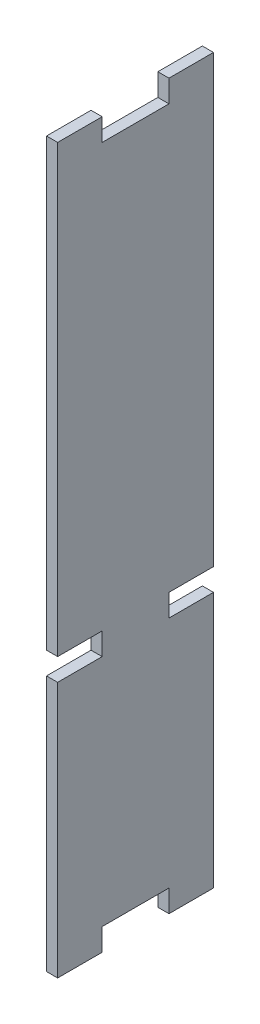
ISO-10303-21;
HEADER;
FILE_DESCRIPTION(('STEP AP214'),'2;1');
FILE_NAME('part.step','',(''),(''),'','','');
FILE_SCHEMA(('AUTOMOTIVE_DESIGN { 1 0 10303 214 1 1 1 1 }'));
ENDSEC;
DATA;
#1=APPLICATION_CONTEXT('core data for automotive mechanical design processes');
#2=APPLICATION_PROTOCOL_DEFINITION('international standard','automotive_design',2000,#1);
#3=PRODUCT_CONTEXT('',#1,'mechanical');
#4=PRODUCT('Part','Part','',(#3));
#5=PRODUCT_RELATED_PRODUCT_CATEGORY('part','',(#4));
#6=PRODUCT_DEFINITION_FORMATION('','',#4);
#7=PRODUCT_DEFINITION_CONTEXT('part definition',#1,'design');
#8=PRODUCT_DEFINITION('design','',#6,#7);
#9=PRODUCT_DEFINITION_SHAPE('','',#8);
#10=(LENGTH_UNIT() NAMED_UNIT(*) SI_UNIT(.MILLI.,.METRE.));
#11=(NAMED_UNIT(*) PLANE_ANGLE_UNIT() SI_UNIT($,.RADIAN.));
#12=(NAMED_UNIT(*) SI_UNIT($,.STERADIAN.) SOLID_ANGLE_UNIT());
#13=UNCERTAINTY_MEASURE_WITH_UNIT(LENGTH_MEASURE(1.E-05),#10,'distance_accuracy_value','');
#14=(GEOMETRIC_REPRESENTATION_CONTEXT(3) GLOBAL_UNCERTAINTY_ASSIGNED_CONTEXT((#13)) GLOBAL_UNIT_ASSIGNED_CONTEXT((#10,
#11,#12)) REPRESENTATION_CONTEXT('',''));
#15=CARTESIAN_POINT('',(0.,0.,0.));
#16=DIRECTION('',(0.,0.,1.));
#17=DIRECTION('',(1.,0.,0.));
#18=AXIS2_PLACEMENT_3D('',#15,#16,#17);
#19=CARTESIAN_POINT('',(3.175,0.,9.525));
#20=DIRECTION('',(0.,0.,1.));
#21=DIRECTION('',(0.,-1.,0.));
#22=AXIS2_PLACEMENT_3D('',#19,#20,#21);
#23=PLANE('',#22);
#24=DIRECTION('',(0.,1.,0.));
#25=VECTOR('',#24,1.);
#26=CARTESIAN_POINT('',(0.,0.,9.525));
#27=LINE('',#26,#25);
#28=CARTESIAN_POINT('',(0.,-6.35,9.525));
#29=VERTEX_POINT('',#28);
#30=CARTESIAN_POINT('',(0.,0.,9.525));
#31=VERTEX_POINT('',#30);
#32=EDGE_CURVE('E199',#29,#31,#27,.T.);
#33=ORIENTED_EDGE('',*,*,#32,.T.);
#34=DIRECTION('',(-1.,0.,0.));
#35=VECTOR('',#34,1.);
#36=CARTESIAN_POINT('',(3.175,0.,9.525));
#37=LINE('',#36,#35);
#38=CARTESIAN_POINT('',(3.175,0.,9.525));
#39=VERTEX_POINT('',#38);
#40=EDGE_CURVE('E11',#39,#31,#37,.T.);
#41=ORIENTED_EDGE('',*,*,#40,.F.);
#42=DIRECTION('',(0.,1.,0.));
#43=VECTOR('',#42,1.);
#44=CARTESIAN_POINT('',(3.175,0.,9.525));
#45=LINE('',#44,#43);
#46=CARTESIAN_POINT('',(3.175,-6.35,9.525));
#47=VERTEX_POINT('',#46);
#48=EDGE_CURVE('E237',#47,#39,#45,.T.);
#49=ORIENTED_EDGE('',*,*,#48,.F.);
#50=DIRECTION('',(-1.,0.,0.));
#51=VECTOR('',#50,1.);
#52=CARTESIAN_POINT('',(3.175,-6.35,9.525));
#53=LINE('',#52,#51);
#54=EDGE_CURVE('E195',#47,#29,#53,.T.);
#55=ORIENTED_EDGE('',*,*,#54,.T.);
#56=EDGE_LOOP('',(#33,#41,#49,#55));
#57=FACE_BOUND('',#56,.T.);
#58=ADVANCED_FACE('F31',(#57),#23,.F.);
#59=CARTESIAN_POINT('',(3.175,0.,9.525));
#60=DIRECTION('',(0.,1.,0.));
#61=DIRECTION('',(0.,0.,1.));
#62=AXIS2_PLACEMENT_3D('',#59,#60,#61);
#63=PLANE('',#62);
#64=DIRECTION('',(0.,0.,-1.));
#65=VECTOR('',#64,1.);
#66=CARTESIAN_POINT('',(0.,0.,9.525));
#67=LINE('',#66,#65);
#68=CARTESIAN_POINT('',(0.,0.,-9.525));
#69=VERTEX_POINT('',#68);
#70=EDGE_CURVE('E202',#31,#69,#67,.T.);
#71=ORIENTED_EDGE('',*,*,#70,.T.);
#72=DIRECTION('',(-1.,0.,0.));
#73=VECTOR('',#72,1.);
#74=CARTESIAN_POINT('',(3.175,0.,-9.525));
#75=LINE('',#74,#73);
#76=CARTESIAN_POINT('',(3.175,0.,-9.525));
#77=VERTEX_POINT('',#76);
#78=EDGE_CURVE('E39',#77,#69,#75,.T.);
#79=ORIENTED_EDGE('',*,*,#78,.F.);
#80=DIRECTION('',(0.,0.,-1.));
#81=VECTOR('',#80,1.);
#82=CARTESIAN_POINT('',(3.175,0.,9.525));
#83=LINE('',#82,#81);
#84=EDGE_CURVE('E126',#39,#77,#83,.T.);
#85=ORIENTED_EDGE('',*,*,#84,.F.);
#86=ORIENTED_EDGE('',*,*,#40,.T.);
#87=EDGE_LOOP('',(#71,#79,#85,#86));
#88=FACE_BOUND('',#87,.T.);
#89=ADVANCED_FACE('F355',(#88),#63,.F.);
#90=CARTESIAN_POINT('',(3.175,0.,-9.525));
#91=DIRECTION('',(0.,0.,-1.));
#92=DIRECTION('',(0.,1.,0.));
#93=AXIS2_PLACEMENT_3D('',#90,#91,#92);
#94=PLANE('',#93);
#95=DIRECTION('',(0.,-1.,0.));
#96=VECTOR('',#95,1.);
#97=CARTESIAN_POINT('',(0.,0.,-9.525));
#98=LINE('',#97,#96);
#99=CARTESIAN_POINT('',(0.,-6.35,-9.525));
#100=VERTEX_POINT('',#99);
#101=EDGE_CURVE('E204',#69,#100,#98,.T.);
#102=ORIENTED_EDGE('',*,*,#101,.T.);
#103=DIRECTION('',(-1.,0.,0.));
#104=VECTOR('',#103,1.);
#105=CARTESIAN_POINT('',(3.175,-6.35,-9.525));
#106=LINE('',#105,#104);
#107=CARTESIAN_POINT('',(3.175,-6.35,-9.525));
#108=VERTEX_POINT('',#107);
#109=EDGE_CURVE('E280',#108,#100,#106,.T.);
#110=ORIENTED_EDGE('',*,*,#109,.F.);
#111=DIRECTION('',(0.,-1.,0.));
#112=VECTOR('',#111,1.);
#113=CARTESIAN_POINT('',(3.175,0.,-9.525));
#114=LINE('',#113,#112);
#115=EDGE_CURVE('E288',#77,#108,#114,.T.);
#116=ORIENTED_EDGE('',*,*,#115,.F.);
#117=ORIENTED_EDGE('',*,*,#78,.T.);
#118=EDGE_LOOP('',(#102,#110,#116,#117));
#119=FACE_BOUND('',#118,.T.);
#120=ADVANCED_FACE('F286',(#119),#94,.F.);
#121=CARTESIAN_POINT('',(3.175,-6.35,-9.525));
#122=DIRECTION('',(0.,1.,0.));
#123=DIRECTION('',(0.,0.,1.));
#124=AXIS2_PLACEMENT_3D('',#121,#122,#123);
#125=PLANE('',#124);
#126=DIRECTION('',(0.,0.,-1.));
#127=VECTOR('',#126,1.);
#128=CARTESIAN_POINT('',(0.,-6.35,-9.525));
#129=LINE('',#128,#127);
#130=CARTESIAN_POINT('',(0.,-6.35,-22.225));
#131=VERTEX_POINT('',#130);
#132=EDGE_CURVE('E206',#100,#131,#129,.T.);
#133=ORIENTED_EDGE('',*,*,#132,.T.);
#134=DIRECTION('',(-1.,0.,0.));
#135=VECTOR('',#134,1.);
#136=CARTESIAN_POINT('',(3.175,-6.35,-22.225));
#137=LINE('',#136,#135);
#138=CARTESIAN_POINT('',(3.175,-6.35,-22.225));
#139=VERTEX_POINT('',#138);
#140=EDGE_CURVE('E277',#139,#131,#137,.T.);
#141=ORIENTED_EDGE('',*,*,#140,.F.);
#142=DIRECTION('',(0.,0.,-1.));
#143=VECTOR('',#142,1.);
#144=CARTESIAN_POINT('',(3.175,-6.35,-9.525));
#145=LINE('',#144,#143);
#146=EDGE_CURVE('E306',#108,#139,#145,.T.);
#147=ORIENTED_EDGE('',*,*,#146,.F.);
#148=ORIENTED_EDGE('',*,*,#109,.T.);
#149=EDGE_LOOP('',(#133,#141,#147,#148));
#150=FACE_BOUND('',#149,.T.);
#151=ADVANCED_FACE('F297',(#150),#125,.F.);
#152=CARTESIAN_POINT('',(3.175,-6.35,-22.225));
#153=DIRECTION('',(0.,0.,1.));
#154=DIRECTION('',(1.,0.,0.));
#155=AXIS2_PLACEMENT_3D('',#152,#153,#154);
#156=PLANE('',#155);
#157=DIRECTION('',(0.,1.,0.));
#158=VECTOR('',#157,1.);
#159=CARTESIAN_POINT('',(0.,-6.35,-22.225));
#160=LINE('',#159,#158);
#161=CARTESIAN_POINT('',(0.,66.675,-22.225));
#162=VERTEX_POINT('',#161);
#163=EDGE_CURVE('E208',#131,#162,#160,.T.);
#164=ORIENTED_EDGE('',*,*,#163,.T.);
#165=DIRECTION('',(-1.,0.,0.));
#166=VECTOR('',#165,1.);
#167=CARTESIAN_POINT('',(3.175,66.675,-22.225));
#168=LINE('',#167,#166);
#169=CARTESIAN_POINT('',(3.175,66.675,-22.225));
#170=VERTEX_POINT('',#169);
#171=EDGE_CURVE('E274',#170,#162,#168,.T.);
#172=ORIENTED_EDGE('',*,*,#171,.F.);
#173=DIRECTION('',(0.,1.,0.));
#174=VECTOR('',#173,1.);
#175=CARTESIAN_POINT('',(3.175,-6.35,-22.225));
#176=LINE('',#175,#174);
#177=EDGE_CURVE('E303',#139,#170,#176,.T.);
#178=ORIENTED_EDGE('',*,*,#177,.F.);
#179=ORIENTED_EDGE('',*,*,#140,.T.);
#180=EDGE_LOOP('',(#164,#172,#178,#179));
#181=FACE_BOUND('',#180,.T.);
#182=ADVANCED_FACE('F301',(#181),#156,.F.);
#183=CARTESIAN_POINT('',(3.175,66.675,-22.225));
#184=DIRECTION('',(0.,-1.,0.));
#185=DIRECTION('',(0.,0.,-1.));
#186=AXIS2_PLACEMENT_3D('',#183,#184,#185);
#187=PLANE('',#186);
#188=DIRECTION('',(0.,0.,1.));
#189=VECTOR('',#188,1.);
#190=CARTESIAN_POINT('',(0.,66.675,-22.225));
#191=LINE('',#190,#189);
#192=CARTESIAN_POINT('',(0.,66.675,-9.52500000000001));
#193=VERTEX_POINT('',#192);
#194=EDGE_CURVE('E210',#162,#193,#191,.T.);
#195=ORIENTED_EDGE('',*,*,#194,.T.);
#196=DIRECTION('',(-1.,0.,0.));
#197=VECTOR('',#196,1.);
#198=CARTESIAN_POINT('',(3.175,66.675,-9.52500000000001));
#199=LINE('',#198,#197);
#200=CARTESIAN_POINT('',(3.175,66.675,-9.52500000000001));
#201=VERTEX_POINT('',#200);
#202=EDGE_CURVE('E271',#201,#193,#199,.T.);
#203=ORIENTED_EDGE('',*,*,#202,.F.);
#204=DIRECTION('',(0.,0.,1.));
#205=VECTOR('',#204,1.);
#206=CARTESIAN_POINT('',(3.175,66.675,-22.225));
#207=LINE('',#206,#205);
#208=EDGE_CURVE('E305',#170,#201,#207,.T.);
#209=ORIENTED_EDGE('',*,*,#208,.F.);
#210=ORIENTED_EDGE('',*,*,#171,.T.);
#211=EDGE_LOOP('',(#195,#203,#209,#210));
#212=FACE_BOUND('',#211,.T.);
#213=ADVANCED_FACE('F368',(#212),#187,.F.);
#214=CARTESIAN_POINT('',(3.175,66.675,-9.52500000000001));
#215=DIRECTION('',(0.,0.,1.));
#216=DIRECTION('',(0.,-1.,0.));
#217=AXIS2_PLACEMENT_3D('',#214,#215,#216);
#218=PLANE('',#217);
#219=DIRECTION('',(0.,1.,0.));
#220=VECTOR('',#219,1.);
#221=CARTESIAN_POINT('',(0.,66.675,-9.52500000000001));
#222=LINE('',#221,#220);
#223=CARTESIAN_POINT('',(0.,73.025,-9.52500000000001));
#224=VERTEX_POINT('',#223);
#225=EDGE_CURVE('E212',#193,#224,#222,.T.);
#226=ORIENTED_EDGE('',*,*,#225,.T.);
#227=DIRECTION('',(-1.,0.,0.));
#228=VECTOR('',#227,1.);
#229=CARTESIAN_POINT('',(3.175,73.025,-9.52500000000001));
#230=LINE('',#229,#228);
#231=CARTESIAN_POINT('',(3.175,73.025,-9.52500000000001));
#232=VERTEX_POINT('',#231);
#233=EDGE_CURVE('E268',#232,#224,#230,.T.);
#234=ORIENTED_EDGE('',*,*,#233,.F.);
#235=DIRECTION('',(0.,1.,0.));
#236=VECTOR('',#235,1.);
#237=CARTESIAN_POINT('',(3.175,66.675,-9.52500000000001));
#238=LINE('',#237,#236);
#239=EDGE_CURVE('E308',#201,#232,#238,.T.);
#240=ORIENTED_EDGE('',*,*,#239,.F.);
#241=ORIENTED_EDGE('',*,*,#202,.T.);
#242=EDGE_LOOP('',(#226,#234,#240,#241));
#243=FACE_BOUND('',#242,.T.);
#244=ADVANCED_FACE('F371',(#243),#218,.F.);
#245=CARTESIAN_POINT('',(3.175,73.025,-9.52500000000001));
#246=DIRECTION('',(0.,1.,0.));
#247=DIRECTION('',(0.,0.,1.));
#248=AXIS2_PLACEMENT_3D('',#245,#246,#247);
#249=PLANE('',#248);
#250=DIRECTION('',(0.,0.,-1.));
#251=VECTOR('',#250,1.);
#252=CARTESIAN_POINT('',(0.,73.025,-9.52500000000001));
#253=LINE('',#252,#251);
#254=CARTESIAN_POINT('',(0.,73.025,-22.225));
#255=VERTEX_POINT('',#254);
#256=EDGE_CURVE('E214',#224,#255,#253,.T.);
#257=ORIENTED_EDGE('',*,*,#256,.T.);
#258=DIRECTION('',(-1.,0.,0.));
#259=VECTOR('',#258,1.);
#260=CARTESIAN_POINT('',(3.175,73.025,-22.225));
#261=LINE('',#260,#259);
#262=CARTESIAN_POINT('',(3.175,73.025,-22.225));
#263=VERTEX_POINT('',#262);
#264=EDGE_CURVE('E265',#263,#255,#261,.T.);
#265=ORIENTED_EDGE('',*,*,#264,.F.);
#266=DIRECTION('',(0.,0.,-1.));
#267=VECTOR('',#266,1.);
#268=CARTESIAN_POINT('',(3.175,73.025,-9.52500000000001));
#269=LINE('',#268,#267);
#270=EDGE_CURVE('E314',#232,#263,#269,.T.);
#271=ORIENTED_EDGE('',*,*,#270,.F.);
#272=ORIENTED_EDGE('',*,*,#233,.T.);
#273=EDGE_LOOP('',(#257,#265,#271,#272));
#274=FACE_BOUND('',#273,.T.);
#275=ADVANCED_FACE('F375',(#274),#249,.F.);
#276=CARTESIAN_POINT('',(3.175,73.025,-22.225));
#277=DIRECTION('',(0.,0.,1.));
#278=DIRECTION('',(1.,0.,0.));
#279=AXIS2_PLACEMENT_3D('',#276,#277,#278);
#280=PLANE('',#279);
#281=DIRECTION('',(0.,1.,0.));
#282=VECTOR('',#281,1.);
#283=CARTESIAN_POINT('',(0.,73.025,-22.225));
#284=LINE('',#283,#282);
#285=CARTESIAN_POINT('',(0.,200.025,-22.225));
#286=VERTEX_POINT('',#285);
#287=EDGE_CURVE('E216',#255,#286,#284,.T.);
#288=ORIENTED_EDGE('',*,*,#287,.T.);
#289=DIRECTION('',(-1.,0.,0.));
#290=VECTOR('',#289,1.);
#291=CARTESIAN_POINT('',(3.175,200.025,-22.225));
#292=LINE('',#291,#290);
#293=CARTESIAN_POINT('',(3.175,200.025,-22.225));
#294=VERTEX_POINT('',#293);
#295=EDGE_CURVE('E262',#294,#286,#292,.T.);
#296=ORIENTED_EDGE('',*,*,#295,.F.);
#297=DIRECTION('',(0.,1.,0.));
#298=VECTOR('',#297,1.);
#299=CARTESIAN_POINT('',(3.175,73.025,-22.225));
#300=LINE('',#299,#298);
#301=EDGE_CURVE('E316',#263,#294,#300,.T.);
#302=ORIENTED_EDGE('',*,*,#301,.F.);
#303=ORIENTED_EDGE('',*,*,#264,.T.);
#304=EDGE_LOOP('',(#288,#296,#302,#303));
#305=FACE_BOUND('',#304,.T.);
#306=ADVANCED_FACE('F379',(#305),#280,.F.);
#307=CARTESIAN_POINT('',(3.175,200.025,-22.225));
#308=DIRECTION('',(0.,-1.,0.));
#309=DIRECTION('',(0.,0.,-1.));
#310=AXIS2_PLACEMENT_3D('',#307,#308,#309);
#311=PLANE('',#310);
#312=DIRECTION('',(0.,0.,1.));
#313=VECTOR('',#312,1.);
#314=CARTESIAN_POINT('',(0.,200.025,-22.225));
#315=LINE('',#314,#313);
#316=CARTESIAN_POINT('',(0.,200.025,-9.52500000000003));
#317=VERTEX_POINT('',#316);
#318=EDGE_CURVE('E218',#286,#317,#315,.T.);
#319=ORIENTED_EDGE('',*,*,#318,.T.);
#320=DIRECTION('',(-1.,0.,0.));
#321=VECTOR('',#320,1.);
#322=CARTESIAN_POINT('',(3.175,200.025,-9.52500000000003));
#323=LINE('',#322,#321);
#324=CARTESIAN_POINT('',(3.175,200.025,-9.52500000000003));
#325=VERTEX_POINT('',#324);
#326=EDGE_CURVE('E259',#325,#317,#323,.T.);
#327=ORIENTED_EDGE('',*,*,#326,.F.);
#328=DIRECTION('',(0.,0.,1.));
#329=VECTOR('',#328,1.);
#330=CARTESIAN_POINT('',(3.175,200.025,-22.225));
#331=LINE('',#330,#329);
#332=EDGE_CURVE('E318',#294,#325,#331,.T.);
#333=ORIENTED_EDGE('',*,*,#332,.F.);
#334=ORIENTED_EDGE('',*,*,#295,.T.);
#335=EDGE_LOOP('',(#319,#327,#333,#334));
#336=FACE_BOUND('',#335,.T.);
#337=ADVANCED_FACE('F383',(#336),#311,.F.);
#338=CARTESIAN_POINT('',(3.175,200.025,-9.52500000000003));
#339=DIRECTION('',(0.,0.,-1.));
#340=DIRECTION('',(-1.,0.,0.));
#341=AXIS2_PLACEMENT_3D('',#338,#339,#340);
#342=PLANE('',#341);
#343=DIRECTION('',(0.,-1.,0.));
#344=VECTOR('',#343,1.);
#345=CARTESIAN_POINT('',(0.,200.025,-9.52500000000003));
#346=LINE('',#345,#344);
#347=CARTESIAN_POINT('',(0.,193.675,-9.52500000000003));
#348=VERTEX_POINT('',#347);
#349=EDGE_CURVE('E220',#317,#348,#346,.T.);
#350=ORIENTED_EDGE('',*,*,#349,.T.);
#351=DIRECTION('',(-1.,0.,0.));
#352=VECTOR('',#351,1.);
#353=CARTESIAN_POINT('',(3.175,193.675,-9.52500000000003));
#354=LINE('',#353,#352);
#355=CARTESIAN_POINT('',(3.175,193.675,-9.52500000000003));
#356=VERTEX_POINT('',#355);
#357=EDGE_CURVE('E256',#356,#348,#354,.T.);
#358=ORIENTED_EDGE('',*,*,#357,.F.);
#359=DIRECTION('',(0.,-1.,0.));
#360=VECTOR('',#359,1.);
#361=CARTESIAN_POINT('',(3.175,200.025,-9.52500000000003));
#362=LINE('',#361,#360);
#363=EDGE_CURVE('E320',#325,#356,#362,.T.);
#364=ORIENTED_EDGE('',*,*,#363,.F.);
#365=ORIENTED_EDGE('',*,*,#326,.T.);
#366=EDGE_LOOP('',(#350,#358,#364,#365));
#367=FACE_BOUND('',#366,.T.);
#368=ADVANCED_FACE('F387',(#367),#342,.F.);
#369=CARTESIAN_POINT('',(3.175,193.675,9.52500000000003));
#370=DIRECTION('',(0.,-1.,0.));
#371=DIRECTION('',(0.,0.,-1.));
#372=AXIS2_PLACEMENT_3D('',#369,#370,#371);
#373=PLANE('',#372);
#374=DIRECTION('',(0.,0.,1.));
#375=VECTOR('',#374,1.);
#376=CARTESIAN_POINT('',(0.,193.675,9.52500000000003));
#377=LINE('',#376,#375);
#378=CARTESIAN_POINT('',(0.,193.675,9.52500000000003));
#379=VERTEX_POINT('',#378);
#380=EDGE_CURVE('E222',#348,#379,#377,.T.);
#381=ORIENTED_EDGE('',*,*,#380,.T.);
#382=DIRECTION('',(-1.,0.,0.));
#383=VECTOR('',#382,1.);
#384=CARTESIAN_POINT('',(3.175,193.675,9.52500000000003));
#385=LINE('',#384,#383);
#386=CARTESIAN_POINT('',(3.175,193.675,9.52500000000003));
#387=VERTEX_POINT('',#386);
#388=EDGE_CURVE('E253',#387,#379,#385,.T.);
#389=ORIENTED_EDGE('',*,*,#388,.F.);
#390=DIRECTION('',(0.,0.,1.));
#391=VECTOR('',#390,1.);
#392=CARTESIAN_POINT('',(3.175,193.675,9.52500000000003));
#393=LINE('',#392,#391);
#394=EDGE_CURVE('E322',#356,#387,#393,.T.);
#395=ORIENTED_EDGE('',*,*,#394,.F.);
#396=ORIENTED_EDGE('',*,*,#357,.T.);
#397=EDGE_LOOP('',(#381,#389,#395,#396));
#398=FACE_BOUND('',#397,.T.);
#399=ADVANCED_FACE('F391',(#398),#373,.F.);
#400=CARTESIAN_POINT('',(3.175,200.025,9.52500000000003));
#401=DIRECTION('',(0.,0.,1.));
#402=DIRECTION('',(1.,0.,0.));
#403=AXIS2_PLACEMENT_3D('',#400,#401,#402);
#404=PLANE('',#403);
#405=DIRECTION('',(0.,1.,0.));
#406=VECTOR('',#405,1.);
#407=CARTESIAN_POINT('',(0.,200.025,9.52500000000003));
#408=LINE('',#407,#406);
#409=CARTESIAN_POINT('',(0.,200.025,9.52500000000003));
#410=VERTEX_POINT('',#409);
#411=EDGE_CURVE('E224',#379,#410,#408,.T.);
#412=ORIENTED_EDGE('',*,*,#411,.T.);
#413=DIRECTION('',(-1.,0.,0.));
#414=VECTOR('',#413,1.);
#415=CARTESIAN_POINT('',(3.175,200.025,9.52500000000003));
#416=LINE('',#415,#414);
#417=CARTESIAN_POINT('',(3.175,200.025,9.52500000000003));
#418=VERTEX_POINT('',#417);
#419=EDGE_CURVE('E250',#418,#410,#416,.T.);
#420=ORIENTED_EDGE('',*,*,#419,.F.);
#421=DIRECTION('',(0.,1.,0.));
#422=VECTOR('',#421,1.);
#423=CARTESIAN_POINT('',(3.175,200.025,9.52500000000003));
#424=LINE('',#423,#422);
#425=EDGE_CURVE('E324',#387,#418,#424,.T.);
#426=ORIENTED_EDGE('',*,*,#425,.F.);
#427=ORIENTED_EDGE('',*,*,#388,.T.);
#428=EDGE_LOOP('',(#412,#420,#426,#427));
#429=FACE_BOUND('',#428,.T.);
#430=ADVANCED_FACE('F395',(#429),#404,.F.);
#431=CARTESIAN_POINT('',(3.175,200.025,22.225));
#432=DIRECTION('',(0.,-1.,0.));
#433=DIRECTION('',(0.,0.,-1.));
#434=AXIS2_PLACEMENT_3D('',#431,#432,#433);
#435=PLANE('',#434);
#436=DIRECTION('',(0.,0.,1.));
#437=VECTOR('',#436,1.);
#438=CARTESIAN_POINT('',(0.,200.025,22.225));
#439=LINE('',#438,#437);
#440=CARTESIAN_POINT('',(0.,200.025,22.225));
#441=VERTEX_POINT('',#440);
#442=EDGE_CURVE('E226',#410,#441,#439,.T.);
#443=ORIENTED_EDGE('',*,*,#442,.T.);
#444=DIRECTION('',(-1.,0.,0.));
#445=VECTOR('',#444,1.);
#446=CARTESIAN_POINT('',(3.175,200.025,22.225));
#447=LINE('',#446,#445);
#448=CARTESIAN_POINT('',(3.175,200.025,22.225));
#449=VERTEX_POINT('',#448);
#450=EDGE_CURVE('E247',#449,#441,#447,.T.);
#451=ORIENTED_EDGE('',*,*,#450,.F.);
#452=DIRECTION('',(0.,0.,1.));
#453=VECTOR('',#452,1.);
#454=CARTESIAN_POINT('',(3.175,200.025,22.225));
#455=LINE('',#454,#453);
#456=EDGE_CURVE('E326',#418,#449,#455,.T.);
#457=ORIENTED_EDGE('',*,*,#456,.F.);
#458=ORIENTED_EDGE('',*,*,#419,.T.);
#459=EDGE_LOOP('',(#443,#451,#457,#458));
#460=FACE_BOUND('',#459,.T.);
#461=ADVANCED_FACE('F399',(#460),#435,.F.);
#462=CARTESIAN_POINT('',(3.175,73.025,22.225));
#463=DIRECTION('',(0.,0.,-1.));
#464=DIRECTION('',(-1.,0.,0.));
#465=AXIS2_PLACEMENT_3D('',#462,#463,#464);
#466=PLANE('',#465);
#467=DIRECTION('',(0.,-1.,0.));
#468=VECTOR('',#467,1.);
#469=CARTESIAN_POINT('',(0.,73.025,22.225));
#470=LINE('',#469,#468);
#471=CARTESIAN_POINT('',(0.,73.025,22.225));
#472=VERTEX_POINT('',#471);
#473=EDGE_CURVE('E228',#441,#472,#470,.T.);
#474=ORIENTED_EDGE('',*,*,#473,.T.);
#475=DIRECTION('',(-1.,0.,0.));
#476=VECTOR('',#475,1.);
#477=CARTESIAN_POINT('',(3.175,73.025,22.225));
#478=LINE('',#477,#476);
#479=CARTESIAN_POINT('',(3.175,73.025,22.225));
#480=VERTEX_POINT('',#479);
#481=EDGE_CURVE('E244',#480,#472,#478,.T.);
#482=ORIENTED_EDGE('',*,*,#481,.F.);
#483=DIRECTION('',(0.,-1.,0.));
#484=VECTOR('',#483,1.);
#485=CARTESIAN_POINT('',(3.175,73.025,22.225));
#486=LINE('',#485,#484);
#487=EDGE_CURVE('E328',#449,#480,#486,.T.);
#488=ORIENTED_EDGE('',*,*,#487,.F.);
#489=ORIENTED_EDGE('',*,*,#450,.T.);
#490=EDGE_LOOP('',(#474,#482,#488,#489));
#491=FACE_BOUND('',#490,.T.);
#492=ADVANCED_FACE('F403',(#491),#466,.F.);
#493=CARTESIAN_POINT('',(3.175,73.025,9.52500000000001));
#494=DIRECTION('',(0.,1.,0.));
#495=DIRECTION('',(0.,0.,1.));
#496=AXIS2_PLACEMENT_3D('',#493,#494,#495);
#497=PLANE('',#496);
#498=DIRECTION('',(0.,0.,-1.));
#499=VECTOR('',#498,1.);
#500=CARTESIAN_POINT('',(0.,73.025,9.52500000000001));
#501=LINE('',#500,#499);
#502=CARTESIAN_POINT('',(0.,73.025,9.52500000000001));
#503=VERTEX_POINT('',#502);
#504=EDGE_CURVE('E230',#472,#503,#501,.T.);
#505=ORIENTED_EDGE('',*,*,#504,.T.);
#506=DIRECTION('',(-1.,0.,0.));
#507=VECTOR('',#506,1.);
#508=CARTESIAN_POINT('',(3.175,73.025,9.52500000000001));
#509=LINE('',#508,#507);
#510=CARTESIAN_POINT('',(3.175,73.025,9.52500000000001));
#511=VERTEX_POINT('',#510);
#512=EDGE_CURVE('E241',#511,#503,#509,.T.);
#513=ORIENTED_EDGE('',*,*,#512,.F.);
#514=DIRECTION('',(0.,0.,-1.));
#515=VECTOR('',#514,1.);
#516=CARTESIAN_POINT('',(3.175,73.025,9.52500000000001));
#517=LINE('',#516,#515);
#518=EDGE_CURVE('E330',#480,#511,#517,.T.);
#519=ORIENTED_EDGE('',*,*,#518,.F.);
#520=ORIENTED_EDGE('',*,*,#481,.T.);
#521=EDGE_LOOP('',(#505,#513,#519,#520));
#522=FACE_BOUND('',#521,.T.);
#523=ADVANCED_FACE('F336',(#522),#497,.F.);
#524=CARTESIAN_POINT('',(3.175,66.675,9.52500000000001));
#525=DIRECTION('',(0.,0.,-1.));
#526=DIRECTION('',(0.,1.,0.));
#527=AXIS2_PLACEMENT_3D('',#524,#525,#526);
#528=PLANE('',#527);
#529=DIRECTION('',(0.,-1.,0.));
#530=VECTOR('',#529,1.);
#531=CARTESIAN_POINT('',(0.,66.675,9.52500000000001));
#532=LINE('',#531,#530);
#533=CARTESIAN_POINT('',(0.,66.675,9.52500000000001));
#534=VERTEX_POINT('',#533);
#535=EDGE_CURVE('E232',#503,#534,#532,.T.);
#536=ORIENTED_EDGE('',*,*,#535,.T.);
#537=DIRECTION('',(-1.,0.,0.));
#538=VECTOR('',#537,1.);
#539=CARTESIAN_POINT('',(3.175,66.675,9.52500000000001));
#540=LINE('',#539,#538);
#541=CARTESIAN_POINT('',(3.175,66.675,9.52500000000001));
#542=VERTEX_POINT('',#541);
#543=EDGE_CURVE('E190',#542,#534,#540,.T.);
#544=ORIENTED_EDGE('',*,*,#543,.F.);
#545=DIRECTION('',(0.,-1.,0.));
#546=VECTOR('',#545,1.);
#547=CARTESIAN_POINT('',(3.175,66.675,9.52500000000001));
#548=LINE('',#547,#546);
#549=EDGE_CURVE('E181',#511,#542,#548,.T.);
#550=ORIENTED_EDGE('',*,*,#549,.F.);
#551=ORIENTED_EDGE('',*,*,#512,.T.);
#552=EDGE_LOOP('',(#536,#544,#550,#551));
#553=FACE_BOUND('',#552,.T.);
#554=ADVANCED_FACE('F340',(#553),#528,.F.);
#555=CARTESIAN_POINT('',(3.175,66.675,22.225));
#556=DIRECTION('',(0.,-1.,0.));
#557=DIRECTION('',(0.,0.,-1.));
#558=AXIS2_PLACEMENT_3D('',#555,#556,#557);
#559=PLANE('',#558);
#560=DIRECTION('',(0.,0.,1.));
#561=VECTOR('',#560,1.);
#562=CARTESIAN_POINT('',(0.,66.675,22.225));
#563=LINE('',#562,#561);
#564=CARTESIAN_POINT('',(0.,66.675,22.225));
#565=VERTEX_POINT('',#564);
#566=EDGE_CURVE('E189',#534,#565,#563,.T.);
#567=ORIENTED_EDGE('',*,*,#566,.T.);
#568=DIRECTION('',(-1.,0.,0.));
#569=VECTOR('',#568,1.);
#570=CARTESIAN_POINT('',(3.175,66.675,22.225));
#571=LINE('',#570,#569);
#572=CARTESIAN_POINT('',(3.175,66.675,22.225));
#573=VERTEX_POINT('',#572);
#574=EDGE_CURVE('E186',#573,#565,#571,.T.);
#575=ORIENTED_EDGE('',*,*,#574,.F.);
#576=DIRECTION('',(0.,0.,1.));
#577=VECTOR('',#576,1.);
#578=CARTESIAN_POINT('',(3.175,66.675,22.225));
#579=LINE('',#578,#577);
#580=EDGE_CURVE('E175',#542,#573,#579,.T.);
#581=ORIENTED_EDGE('',*,*,#580,.F.);
#582=ORIENTED_EDGE('',*,*,#543,.T.);
#583=EDGE_LOOP('',(#567,#575,#581,#582));
#584=FACE_BOUND('',#583,.T.);
#585=ADVANCED_FACE('F187',(#584),#559,.F.);
#586=CARTESIAN_POINT('',(3.175,-6.35,22.225));
#587=DIRECTION('',(0.,0.,-1.));
#588=DIRECTION('',(-1.,0.,0.));
#589=AXIS2_PLACEMENT_3D('',#586,#587,#588);
#590=PLANE('',#589);
#591=DIRECTION('',(0.,-1.,0.));
#592=VECTOR('',#591,1.);
#593=CARTESIAN_POINT('',(0.,-6.35,22.225));
#594=LINE('',#593,#592);
#595=CARTESIAN_POINT('',(0.,-6.35,22.225));
#596=VERTEX_POINT('',#595);
#597=EDGE_CURVE('E112',#565,#596,#594,.T.);
#598=ORIENTED_EDGE('',*,*,#597,.T.);
#599=DIRECTION('',(-1.,0.,0.));
#600=VECTOR('',#599,1.);
#601=CARTESIAN_POINT('',(3.175,-6.35,22.225));
#602=LINE('',#601,#600);
#603=CARTESIAN_POINT('',(3.175,-6.35,22.225));
#604=VERTEX_POINT('',#603);
#605=EDGE_CURVE('E191',#604,#596,#602,.T.);
#606=ORIENTED_EDGE('',*,*,#605,.F.);
#607=DIRECTION('',(0.,-1.,0.));
#608=VECTOR('',#607,1.);
#609=CARTESIAN_POINT('',(3.175,-6.35,22.225));
#610=LINE('',#609,#608);
#611=EDGE_CURVE('E179',#573,#604,#610,.T.);
#612=ORIENTED_EDGE('',*,*,#611,.F.);
#613=ORIENTED_EDGE('',*,*,#574,.T.);
#614=EDGE_LOOP('',(#598,#606,#612,#613));
#615=FACE_BOUND('',#614,.T.);
#616=ADVANCED_FACE('F193',(#615),#590,.F.);
#617=CARTESIAN_POINT('',(3.175,-6.35,9.525));
#618=DIRECTION('',(0.,1.,0.));
#619=DIRECTION('',(0.,0.,1.));
#620=AXIS2_PLACEMENT_3D('',#617,#618,#619);
#621=PLANE('',#620);
#622=DIRECTION('',(0.,0.,-1.));
#623=VECTOR('',#622,1.);
#624=CARTESIAN_POINT('',(0.,-6.35,9.525));
#625=LINE('',#624,#623);
#626=EDGE_CURVE('E118',#596,#29,#625,.T.);
#627=ORIENTED_EDGE('',*,*,#626,.T.);
#628=ORIENTED_EDGE('',*,*,#54,.F.);
#629=DIRECTION('',(0.,0.,-1.));
#630=VECTOR('',#629,1.);
#631=CARTESIAN_POINT('',(3.175,-6.35,9.525));
#632=LINE('',#631,#630);
#633=EDGE_CURVE('E47',#604,#47,#632,.T.);
#634=ORIENTED_EDGE('',*,*,#633,.F.);
#635=ORIENTED_EDGE('',*,*,#605,.T.);
#636=EDGE_LOOP('',(#627,#628,#634,#635));
#637=FACE_BOUND('',#636,.T.);
#638=ADVANCED_FACE('F344',(#637),#621,.F.);
#639=CARTESIAN_POINT('',(3.175,-6.35,9.525));
#640=DIRECTION('',(-1.,0.,0.));
#641=DIRECTION('',(0.,0.,1.));
#642=AXIS2_PLACEMENT_3D('',#639,#640,#641);
#643=PLANE('',#642);
#644=ORIENTED_EDGE('',*,*,#48,.T.);
#645=ORIENTED_EDGE('',*,*,#84,.T.);
#646=ORIENTED_EDGE('',*,*,#115,.T.);
#647=ORIENTED_EDGE('',*,*,#146,.T.);
#648=ORIENTED_EDGE('',*,*,#177,.T.);
#649=ORIENTED_EDGE('',*,*,#208,.T.);
#650=ORIENTED_EDGE('',*,*,#239,.T.);
#651=ORIENTED_EDGE('',*,*,#270,.T.);
#652=ORIENTED_EDGE('',*,*,#301,.T.);
#653=ORIENTED_EDGE('',*,*,#332,.T.);
#654=ORIENTED_EDGE('',*,*,#363,.T.);
#655=ORIENTED_EDGE('',*,*,#394,.T.);
#656=ORIENTED_EDGE('',*,*,#425,.T.);
#657=ORIENTED_EDGE('',*,*,#456,.T.);
#658=ORIENTED_EDGE('',*,*,#487,.T.);
#659=ORIENTED_EDGE('',*,*,#518,.T.);
#660=ORIENTED_EDGE('',*,*,#549,.T.);
#661=ORIENTED_EDGE('',*,*,#580,.T.);
#662=ORIENTED_EDGE('',*,*,#611,.T.);
#663=ORIENTED_EDGE('',*,*,#633,.T.);
#664=EDGE_LOOP('',(#644,#645,#646,#647,#648,#649,#650,#651,#652,#653,#654,#655,#656,#657,#658,
#659,#660,#661,#662,#663));
#665=FACE_BOUND('',#664,.T.);
#666=ADVANCED_FACE('F177',(#665),#643,.F.);
#667=CARTESIAN_POINT('',(0.,-6.35,9.525));
#668=DIRECTION('',(-1.,0.,0.));
#669=DIRECTION('',(0.,0.,1.));
#670=AXIS2_PLACEMENT_3D('',#667,#668,#669);
#671=PLANE('',#670);
#672=ORIENTED_EDGE('',*,*,#32,.F.);
#673=ORIENTED_EDGE('',*,*,#626,.F.);
#674=ORIENTED_EDGE('',*,*,#597,.F.);
#675=ORIENTED_EDGE('',*,*,#566,.F.);
#676=ORIENTED_EDGE('',*,*,#535,.F.);
#677=ORIENTED_EDGE('',*,*,#504,.F.);
#678=ORIENTED_EDGE('',*,*,#473,.F.);
#679=ORIENTED_EDGE('',*,*,#442,.F.);
#680=ORIENTED_EDGE('',*,*,#411,.F.);
#681=ORIENTED_EDGE('',*,*,#380,.F.);
#682=ORIENTED_EDGE('',*,*,#349,.F.);
#683=ORIENTED_EDGE('',*,*,#318,.F.);
#684=ORIENTED_EDGE('',*,*,#287,.F.);
#685=ORIENTED_EDGE('',*,*,#256,.F.);
#686=ORIENTED_EDGE('',*,*,#225,.F.);
#687=ORIENTED_EDGE('',*,*,#194,.F.);
#688=ORIENTED_EDGE('',*,*,#163,.F.);
#689=ORIENTED_EDGE('',*,*,#132,.F.);
#690=ORIENTED_EDGE('',*,*,#101,.F.);
#691=ORIENTED_EDGE('',*,*,#70,.F.);
#692=EDGE_LOOP('',(#672,#673,#674,#675,#676,#677,#678,#679,#680,#681,#682,#683,#684,#685,#686,
#687,#688,#689,#690,#691));
#693=FACE_BOUND('',#692,.T.);
#694=ADVANCED_FACE('F292',(#693),#671,.T.);
#695=CLOSED_SHELL('',(#58,#89,#120,#151,#182,#213,#244,#275,#306,#337,#368,#399,#430,#461,#492,
#523,#554,#585,#616,#638,#666,#694));
#696=MANIFOLD_SOLID_BREP('B2',#695);
#697=ADVANCED_BREP_SHAPE_REPRESENTATION('',(#18,#696),#14);
#698=SHAPE_DEFINITION_REPRESENTATION(#9,#697);
ENDSEC;
END-ISO-10303-21;
